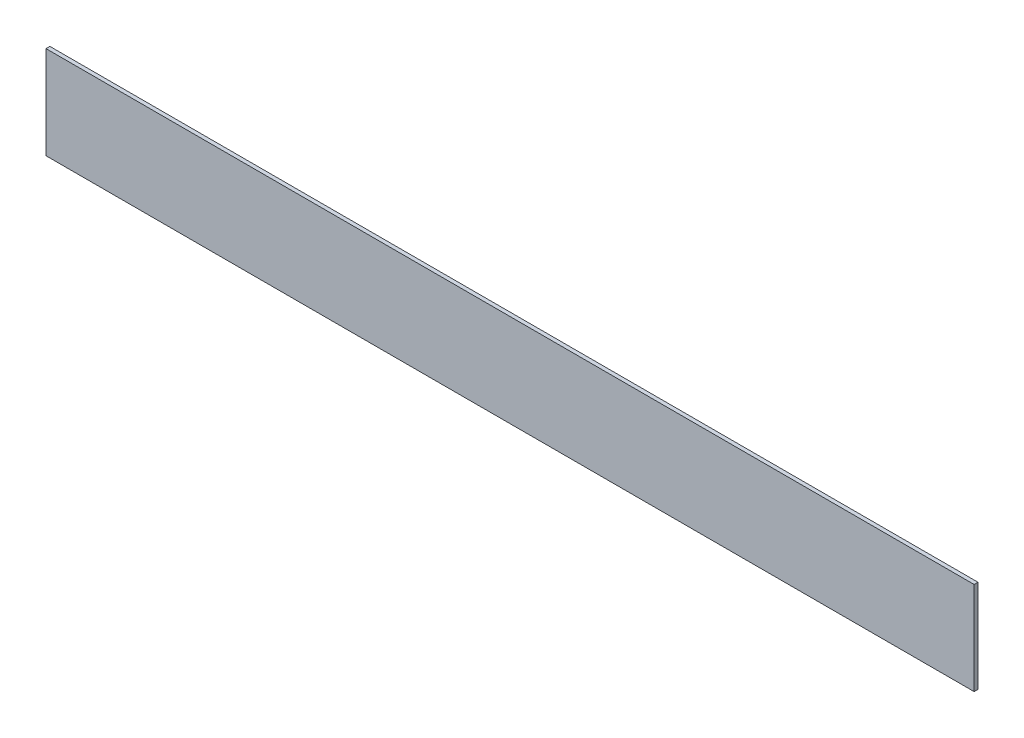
from build123d import *

# Parameters (mm, degrees)
SKETCH1_W      = 762
SKETCH1_H      = 76.2
EXTRUDE1_DEPTH = 3.175


with BuildPart() as part:
    # Sketch1 → Extrude1 (new body)
    with BuildSketch(Plane.XY):
        with Locations((285.095922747, 14.471459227)):
            Rectangle(SKETCH1_W, SKETCH1_H)
    extrude(amount=EXTRUDE1_DEPTH)


solid = part.part
